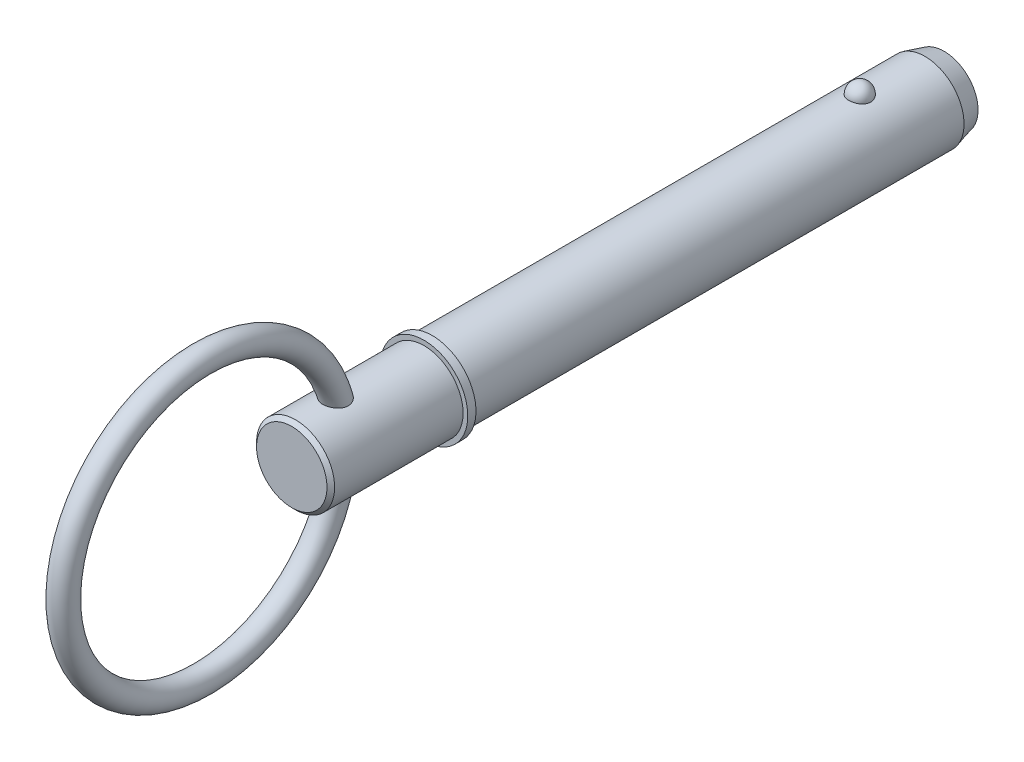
from build123d import *

# Parameters (mm, degrees)
SKETCH2_R           = 7.145
BOSS_EXTRUDE1_DEPTH = 76.2
BOSS_EXTRUDE2_START = 17.45
SKETCH3_R           = 7.145
BOSS_EXTRUDE2_DEPTH = 17.45
CHAMFER1_SIZE       = 3.5
CHAMFER1_SIZE2      = 0.937822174
SKETCH20_W          = 1.5
SKETCH20_H          = 8
SKETCH21_R          = 7.145
BOSS_EXTRUDE3_DEPTH = 25.7
CHAMFER2_SIZE       = 0.7
SKETCH24_R          = 2.25


with BuildPart() as part:
    # Sketch2 → Boss-Extrude1 (new body)
    with BuildSketch(Plane.XY):
        with Locations(Location((0, 0, 0), (0, 0, 180))):
            Circle(SKETCH2_R)
    extrude(amount=BOSS_EXTRUDE1_DEPTH)

    # Sketch3 → Boss-Extrude2 (add)
    with BuildSketch(Plane(origin=(0, 0, 0), x_dir=(-1, 0, 0), z_dir=(0, 0, -1)).offset(BOSS_EXTRUDE2_START)):
        Circle(SKETCH3_R)
    extrude(amount=-BOSS_EXTRUDE2_DEPTH)

    # Chamfer1
    chamfer1_edges = [part.edges().sort_by_distance(p)[0] for p in [
        (7.145, 0, -17.45),
    ]]
    chamfer1_side = [part.faces().sort_by_distance(p)[0] for p in [
        (7.145, 0, 29.375),
    ]]
    chamfer(chamfer1_edges, length=CHAMFER1_SIZE, length2=CHAMFER1_SIZE2, reference=chamfer1_side[0])

    # Sketch18 → Revolve1 (revolve)
    with BuildSketch(Plane(origin=(0, 0, 0), x_dir=(0, 0, -1), z_dir=(1, 0, 0))):
        with BuildLine():
            Line((2.02, 9.165), (2.02, 5.125))
            ThreePointArc((2.02, 5.125), (0, 7.145), (2.02, 9.165))
        make_face()
    revolve(axis=Axis((0, 9.165, -2.02), (0, -1, 0)))

    # Sketch20 → Revolve2 (revolve)
    with BuildSketch(Plane(origin=(0, 0, 0), x_dir=(0, 0, -1), z_dir=(1, 0, 0)), mode=Mode.PRIVATE) as revolve2_sk:
        with Locations((-76.95, 4)):
            Rectangle(SKETCH20_W, SKETCH20_H)
    revolve(revolve2_sk.sketch.rotate(Axis((0, 0, 33.728787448), (0, 0, 1)), 90), axis=Axis((0, 0, 33.728787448), (0, 0, 1)))

    # Sketch21 → Boss-Extrude3 (add)
    with BuildSketch(Plane(origin=(0, 0, 76.2), x_dir=(-1, 0, 0), z_dir=(0, 0, -1))):
        Circle(SKETCH21_R)
    extrude(amount=-BOSS_EXTRUDE3_DEPTH)

    # Chamfer2
    chamfer2_edges = [part.edges().sort_by_distance(p)[0] for p in [
        (7.145, 0, 101.9),
    ]]
    chamfer(chamfer2_edges, length=CHAMFER2_SIZE)

    # Sweep1: sweep along a path in Sketch23
    with BuildLine(Plane(origin=(0, 0, 0), x_dir=(0, 0, -1), z_dir=(1, 0, 0))) as sweep1_path:
        CenterArc((-118.3, 0), 25.4, 0, 360)
    # Sketch24 → Sweep1 (sweep)
    with BuildSketch(Plane(origin=(0, 0, 0), x_dir=(1, 0, 0), z_dir=(0, 1, 0))):
        with Locations((0, -92.9)):
            Circle(SKETCH24_R)
    sweep(path=sweep1_path.line)


solid = part.part
